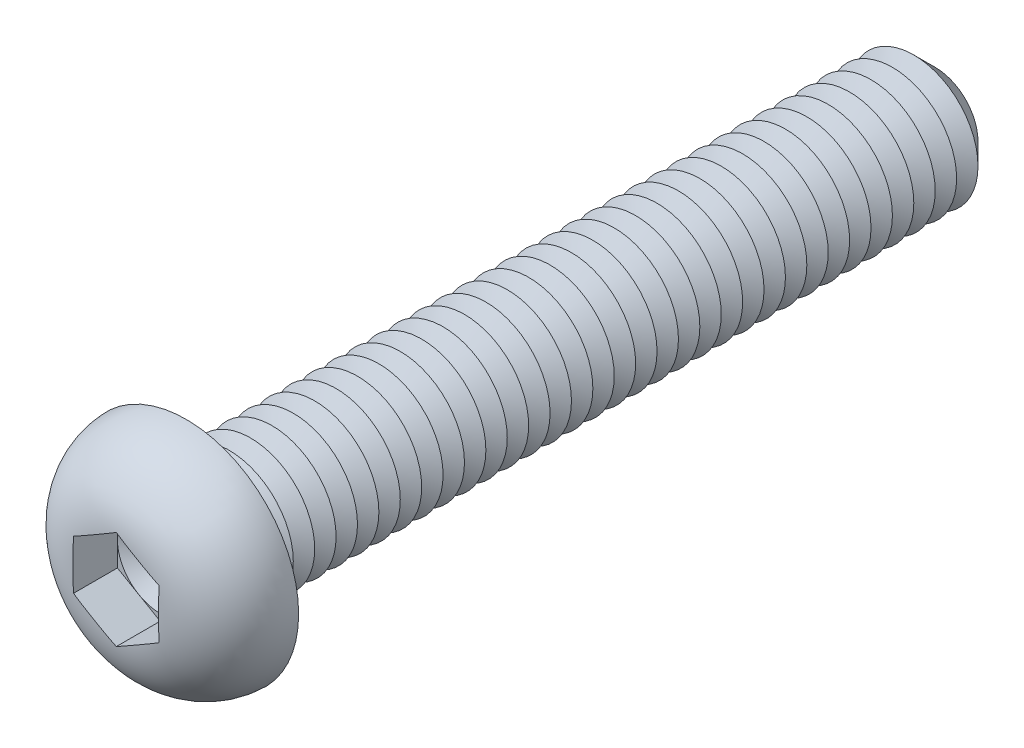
from build123d import *

# Parameters (mm, degrees)
CUT_EXTRUDE1_DEPTH  = 2.08
SKETCH4_R           = 3
BOSS_EXTRUDE1_DEPTH = 35
CHAMFER1_SIZE       = 1
LPATTERN1_COUNT     = 33
LPATTERN1_PITCH     = 1
FILLET2_R           = 0.5


with BuildPart() as part:
    # Sketch2 → Revolve1 (revolve)
    with BuildSketch(Plane(origin=(0, 0, 0), x_dir=(0, 0, -1), z_dir=(1, 0, 0)), mode=Mode.PRIVATE) as revolve1_sk:
        with BuildLine():
            Line((0, 0), (-3.3, 0))
            Line((-3.3, 0), (-3.3, 1.851470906))
            ThreePointArc((-3.3, 1.851470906), (-2.339262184, 4.220014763), (0, 5.25))
            Line((0, 5.25), (0, 0))
        make_face()
    revolve(revolve1_sk.sketch.rotate(Axis((0, 0, 47.934239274), (0, 0, -1)), 90), axis=Axis((0, 0, 47.934239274), (0, 0, -1)))

    # Sketch3 → Cut-Extrude1 (cut)
    with BuildSketch(Plane.XY.offset(3.3)):
        Polygon((0, 2.309401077), (-2, 1.154700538), (-2, -1.154700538), (0, -2.309401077), (2, -1.154700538), (2, 1.154700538), align=None)
    extrude(amount=-CUT_EXTRUDE1_DEPTH, mode=Mode.SUBTRACT)

    # Sketch4 → Boss-Extrude1 (add)
    with BuildSketch(Plane(origin=(0, 0, 0), x_dir=(-1, 0, 0), z_dir=(0, 0, -1))):
        Circle(SKETCH4_R)
    extrude(amount=BOSS_EXTRUDE1_DEPTH)

    # Chamfer1
    chamfer1_edges = [part.edges().sort_by_distance(p)[0] for p in [
        (3, 0, -35),
    ]]
    chamfer(chamfer1_edges, length=CHAMFER1_SIZE)

    # Sketch5 → Cut-Revolve1 (revolve, cut)
    with BuildSketch(Plane(origin=(0, 0, 0), x_dir=(0, 0, -1), z_dir=(1, 0, 0)), mode=Mode.PRIVATE) as cut_revolve1_sk:
        Polygon((1, 3), (2, 3), (1.5, 2.133974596), align=None)
    cut_revolve1 = revolve(cut_revolve1_sk.sketch.rotate(Axis((0, 0, 47.934239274), (0, 0, -1)), 90), axis=Axis((0, 0, 47.934239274), (0, 0, -1)), mode=Mode.SUBTRACT)

    # LPattern1: Cut-Revolve1 ×33
    with Locations(*[(0, 0, -i * LPATTERN1_PITCH) for i in range(1, LPATTERN1_COUNT)]):
        add(cut_revolve1, mode=Mode.SUBTRACT)

    # Fillet2
    fillet2_edges = [part.edges().sort_by_distance(p)[0] for p in [
        (3, 0, 0),
    ]]
    fillet(fillet2_edges, radius=FILLET2_R)

    # Cut-Extrude2 cone 1 section (on through the dimple's axis) → Cut-Extrude2 (revolve, cut)
    with BuildSketch(Plane(origin=(0, 0, 1.22), x_dir=(0, -1, 0), z_dir=(1, 0, 0))):
        Polygon((0, 0), (2, 0), (0, 1.154700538), align=None)
    revolve(axis=Axis((0, 0, 1.22), (0, 0, -1)), mode=Mode.SUBTRACT)


solid = part.part
